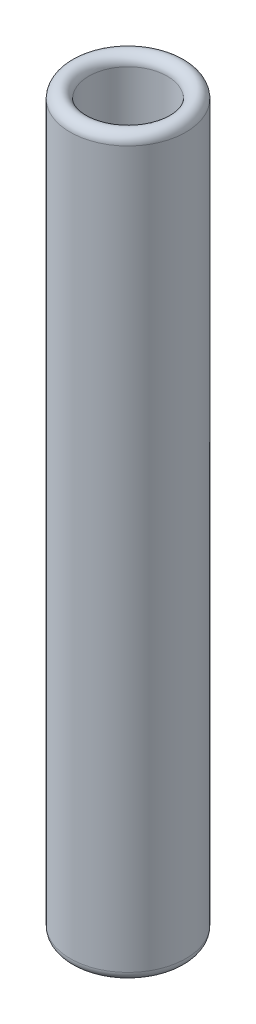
ISO-10303-21;
HEADER;
FILE_DESCRIPTION(('STEP AP214'),'2;1');
FILE_NAME('part.step','',(''),(''),'','','');
FILE_SCHEMA(('AUTOMOTIVE_DESIGN { 1 0 10303 214 1 1 1 1 }'));
ENDSEC;
DATA;
#1=APPLICATION_CONTEXT('core data for automotive mechanical design processes');
#2=APPLICATION_PROTOCOL_DEFINITION('international standard','automotive_design',2000,#1);
#3=PRODUCT_CONTEXT('',#1,'mechanical');
#4=PRODUCT('Part','Part','',(#3));
#5=PRODUCT_RELATED_PRODUCT_CATEGORY('part','',(#4));
#6=PRODUCT_DEFINITION_FORMATION('','',#4);
#7=PRODUCT_DEFINITION_CONTEXT('part definition',#1,'design');
#8=PRODUCT_DEFINITION('design','',#6,#7);
#9=PRODUCT_DEFINITION_SHAPE('','',#8);
#10=(LENGTH_UNIT() NAMED_UNIT(*) SI_UNIT(.MILLI.,.METRE.));
#11=(NAMED_UNIT(*) PLANE_ANGLE_UNIT() SI_UNIT($,.RADIAN.));
#12=(NAMED_UNIT(*) SI_UNIT($,.STERADIAN.) SOLID_ANGLE_UNIT());
#13=UNCERTAINTY_MEASURE_WITH_UNIT(LENGTH_MEASURE(1.E-05),#10,'distance_accuracy_value','');
#14=(GEOMETRIC_REPRESENTATION_CONTEXT(3) GLOBAL_UNCERTAINTY_ASSIGNED_CONTEXT((#13)) GLOBAL_UNIT_ASSIGNED_CONTEXT((#10,
#11,#12)) REPRESENTATION_CONTEXT('',''));
#15=CARTESIAN_POINT('',(0.,0.,0.));
#16=DIRECTION('',(0.,0.,1.));
#17=DIRECTION('',(1.,0.,0.));
#18=AXIS2_PLACEMENT_3D('',#15,#16,#17);
#19=CARTESIAN_POINT('',(0.,0.3683,0.));
#20=DIRECTION('',(0.,1.,0.));
#21=DIRECTION('',(0.,0.,1.));
#22=AXIS2_PLACEMENT_3D('',#19,#20,#21);
#23=TOROIDAL_SURFACE('',#22,1.9177,0.3683);
#24=CARTESIAN_POINT('',(0.,0.368299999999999,0.));
#25=DIRECTION('',(0.,1.,0.));
#26=DIRECTION('',(0.,0.,1.));
#27=AXIS2_PLACEMENT_3D('',#24,#25,#26);
#28=CIRCLE('',#27,2.286);
#29=CARTESIAN_POINT('',(0.,0.368299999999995,-2.286));
#30=VERTEX_POINT('',#29);
#31=EDGE_CURVE('E41',#30,#30,#28,.T.);
#32=ORIENTED_EDGE('',*,*,#31,.F.);
#33=EDGE_LOOP('',(#32));
#34=FACE_BOUND('',#33,.T.);
#35=CARTESIAN_POINT('',(0.,0.368300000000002,0.));
#36=DIRECTION('',(0.,1.,0.));
#37=DIRECTION('',(0.,0.,1.));
#38=AXIS2_PLACEMENT_3D('',#35,#36,#37);
#39=CIRCLE('',#38,1.5494);
#40=CARTESIAN_POINT('',(0.,0.368300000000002,-1.5494));
#41=VERTEX_POINT('',#40);
#42=EDGE_CURVE('E10',#41,#41,#39,.F.);
#43=ORIENTED_EDGE('',*,*,#42,.F.);
#44=EDGE_LOOP('',(#43));
#45=FACE_BOUND('',#44,.T.);
#46=ADVANCED_FACE('F34',(#34,#45),#23,.T.);
#47=CARTESIAN_POINT('',(0.,28.6317,0.));
#48=DIRECTION('',(0.,1.,0.));
#49=DIRECTION('',(0.,0.,1.));
#50=AXIS2_PLACEMENT_3D('',#47,#48,#49);
#51=TOROIDAL_SURFACE('',#50,1.9177,0.3683);
#52=CARTESIAN_POINT('',(0.,28.6317,0.));
#53=DIRECTION('',(0.,1.,0.));
#54=DIRECTION('',(0.,0.,1.));
#55=AXIS2_PLACEMENT_3D('',#52,#53,#54);
#56=CIRCLE('',#55,2.286);
#57=CARTESIAN_POINT('',(0.,28.6317,-2.286));
#58=VERTEX_POINT('',#57);
#59=EDGE_CURVE('E49',#58,#58,#56,.F.);
#60=ORIENTED_EDGE('',*,*,#59,.F.);
#61=EDGE_LOOP('',(#60));
#62=FACE_BOUND('',#61,.T.);
#63=CARTESIAN_POINT('',(0.,28.6317,0.));
#64=DIRECTION('',(0.,1.,0.));
#65=DIRECTION('',(0.,0.,1.));
#66=AXIS2_PLACEMENT_3D('',#63,#64,#65);
#67=CIRCLE('',#66,1.5494);
#68=CARTESIAN_POINT('',(0.,28.6317,-1.5494));
#69=VERTEX_POINT('',#68);
#70=EDGE_CURVE('E45',#69,#69,#67,.T.);
#71=ORIENTED_EDGE('',*,*,#70,.F.);
#72=EDGE_LOOP('',(#71));
#73=FACE_BOUND('',#72,.T.);
#74=ADVANCED_FACE('F57',(#62,#73),#51,.T.);
#75=CARTESIAN_POINT('',(0.,29.,0.));
#76=DIRECTION('',(0.,-1.,0.));
#77=DIRECTION('',(0.,0.,-1.));
#78=AXIS2_PLACEMENT_3D('',#75,#76,#77);
#79=CYLINDRICAL_SURFACE('',#78,2.286);
#80=CARTESIAN_POINT('',(0.,0.368299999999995,-2.286));
#81=CARTESIAN_POINT('',(0.,0.662710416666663,-2.286));
#82=CARTESIAN_POINT('',(0.,0.957120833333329,-2.286));
#83=CARTESIAN_POINT('',(0.,1.54594166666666,-2.286));
#84=CARTESIAN_POINT('',(0.,1.84035208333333,-2.286));
#85=CARTESIAN_POINT('',(0.,2.42917291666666,-2.286));
#86=CARTESIAN_POINT('',(0.,2.72358333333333,-2.286));
#87=CARTESIAN_POINT('',(0.,3.31240416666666,-2.286));
#88=CARTESIAN_POINT('',(0.,3.60681458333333,-2.286));
#89=CARTESIAN_POINT('',(0.,4.19563541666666,-2.286));
#90=CARTESIAN_POINT('',(0.,4.49004583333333,-2.286));
#91=CARTESIAN_POINT('',(0.,5.07886666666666,-2.286));
#92=CARTESIAN_POINT('',(0.,5.37327708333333,-2.286));
#93=CARTESIAN_POINT('',(0.,5.96209791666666,-2.286));
#94=CARTESIAN_POINT('',(0.,6.25650833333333,-2.286));
#95=CARTESIAN_POINT('',(0.,6.84532916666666,-2.286));
#96=CARTESIAN_POINT('',(0.,7.13973958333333,-2.286));
#97=CARTESIAN_POINT('',(0.,7.72856041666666,-2.286));
#98=CARTESIAN_POINT('',(0.,8.02297083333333,-2.286));
#99=CARTESIAN_POINT('',(0.,8.61179166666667,-2.286));
#100=CARTESIAN_POINT('',(0.,8.90620208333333,-2.286));
#101=CARTESIAN_POINT('',(0.,9.49502291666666,-2.286));
#102=CARTESIAN_POINT('',(0.,9.78943333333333,-2.286));
#103=CARTESIAN_POINT('',(0.,10.3782541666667,-2.286));
#104=CARTESIAN_POINT('',(0.,10.6726645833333,-2.286));
#105=CARTESIAN_POINT('',(0.,11.2614854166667,-2.286));
#106=CARTESIAN_POINT('',(0.,11.5558958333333,-2.286));
#107=CARTESIAN_POINT('',(0.,12.1447166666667,-2.286));
#108=CARTESIAN_POINT('',(0.,12.4391270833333,-2.286));
#109=CARTESIAN_POINT('',(0.,13.0279479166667,-2.286));
#110=CARTESIAN_POINT('',(0.,13.3223583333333,-2.286));
#111=CARTESIAN_POINT('',(0.,13.9111791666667,-2.286));
#112=CARTESIAN_POINT('',(0.,14.2055895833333,-2.286));
#113=CARTESIAN_POINT('',(0.,14.7944104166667,-2.286));
#114=CARTESIAN_POINT('',(0.,15.0888208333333,-2.286));
#115=CARTESIAN_POINT('',(0.,15.6776416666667,-2.286));
#116=CARTESIAN_POINT('',(0.,15.9720520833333,-2.286));
#117=CARTESIAN_POINT('',(0.,16.5608729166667,-2.286));
#118=CARTESIAN_POINT('',(0.,16.8552833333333,-2.286));
#119=CARTESIAN_POINT('',(0.,17.4441041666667,-2.286));
#120=CARTESIAN_POINT('',(0.,17.7385145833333,-2.286));
#121=CARTESIAN_POINT('',(0.,18.3273354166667,-2.286));
#122=CARTESIAN_POINT('',(0.,18.6217458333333,-2.286));
#123=CARTESIAN_POINT('',(0.,19.2105666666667,-2.286));
#124=CARTESIAN_POINT('',(0.,19.5049770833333,-2.286));
#125=CARTESIAN_POINT('',(0.,20.0937979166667,-2.286));
#126=CARTESIAN_POINT('',(0.,20.3882083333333,-2.286));
#127=CARTESIAN_POINT('',(0.,20.9770291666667,-2.286));
#128=CARTESIAN_POINT('',(0.,21.2714395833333,-2.286));
#129=CARTESIAN_POINT('',(0.,21.8602604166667,-2.286));
#130=CARTESIAN_POINT('',(0.,22.1546708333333,-2.286));
#131=CARTESIAN_POINT('',(0.,22.7434916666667,-2.286));
#132=CARTESIAN_POINT('',(0.,23.0379020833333,-2.286));
#133=CARTESIAN_POINT('',(0.,23.6267229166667,-2.286));
#134=CARTESIAN_POINT('',(0.,23.9211333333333,-2.286));
#135=CARTESIAN_POINT('',(0.,24.5099541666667,-2.286));
#136=CARTESIAN_POINT('',(0.,24.8043645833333,-2.286));
#137=CARTESIAN_POINT('',(0.,25.3931854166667,-2.286));
#138=CARTESIAN_POINT('',(0.,25.6875958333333,-2.286));
#139=CARTESIAN_POINT('',(0.,26.2764166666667,-2.286));
#140=CARTESIAN_POINT('',(0.,26.5708270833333,-2.286));
#141=CARTESIAN_POINT('',(0.,27.1596479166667,-2.286));
#142=CARTESIAN_POINT('',(0.,27.4540583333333,-2.286));
#143=CARTESIAN_POINT('',(0.,28.0428791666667,-2.286));
#144=CARTESIAN_POINT('',(0.,28.3372895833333,-2.286));
#145=CARTESIAN_POINT('',(0.,28.6317,-2.286));
#146=B_SPLINE_CURVE_WITH_KNOTS('',3,(#80,#81,#82,#83,#84,#85,#86,#87,#88,#89,#90,#91,#92,#93,
#94,#95,#96,#97,#98,#99,#100,#101,#102,#103,#104,#105,#106,#107,#108,#109,#110,#111,#112,#113,
#114,#115,#116,#117,#118,#119,#120,#121,#122,#123,#124,#125,#126,#127,#128,#129,#130,#131,#132,
#133,#134,#135,#136,#137,#138,#139,#140,#141,#142,#143,#144,#145),.UNSPECIFIED.,.F.,.F.,(4,2,2,
2,2,2,2,2,2,2,2,2,2,2,2,2,2,2,2,2,2,2,2,2,2,2,2,2,2,2,2,2,4),(0.,0.883231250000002,1.7664625,
2.64969375,3.532925,4.41615625,5.2993875,6.18261875,7.06585,7.94908125,8.8323125,9.71554375,
10.598775,11.48200625,12.3652375,13.24846875,14.1317,15.01493125,15.8981625,16.78139375,
17.664625,18.54785625,19.4310875,20.31431875,21.19755,22.08078125,22.9640125,23.84724375,
24.730475,25.61370625,26.4969375,27.38016875,28.2634),.UNSPECIFIED.);
#147=EDGE_CURVE('BSEAM55',#30,#58,#146,.T.);
#148=ORIENTED_EDGE('',*,*,#31,.T.);
#149=ORIENTED_EDGE('',*,*,#59,.T.);
#150=ORIENTED_EDGE('',*,*,#147,.T.);
#151=ORIENTED_EDGE('',*,*,#147,.F.);
#152=EDGE_LOOP('',(#148,#150,#149,#151));
#153=FACE_BOUND('',#152,.T.);
#154=ADVANCED_FACE('F55',(#153),#79,.T.);
#155=CARTESIAN_POINT('',(0.,29.,0.));
#156=DIRECTION('',(0.,-1.,0.));
#157=DIRECTION('',(0.,0.,-1.));
#158=AXIS2_PLACEMENT_3D('',#155,#156,#157);
#159=CYLINDRICAL_SURFACE('',#158,1.5494);
#160=CARTESIAN_POINT('',(0.,0.368300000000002,-1.5494));
#161=CARTESIAN_POINT('',(0.,0.662710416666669,-1.5494));
#162=CARTESIAN_POINT('',(0.,0.957120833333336,-1.5494));
#163=CARTESIAN_POINT('',(0.,1.54594166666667,-1.5494));
#164=CARTESIAN_POINT('',(0.,1.84035208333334,-1.5494));
#165=CARTESIAN_POINT('',(0.,2.42917291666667,-1.5494));
#166=CARTESIAN_POINT('',(0.,2.72358333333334,-1.5494));
#167=CARTESIAN_POINT('',(0.,3.31240416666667,-1.5494));
#168=CARTESIAN_POINT('',(0.,3.60681458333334,-1.5494));
#169=CARTESIAN_POINT('',(0.,4.19563541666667,-1.5494));
#170=CARTESIAN_POINT('',(0.,4.49004583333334,-1.5494));
#171=CARTESIAN_POINT('',(0.,5.07886666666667,-1.5494));
#172=CARTESIAN_POINT('',(0.,5.37327708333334,-1.5494));
#173=CARTESIAN_POINT('',(0.,5.96209791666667,-1.5494));
#174=CARTESIAN_POINT('',(0.,6.25650833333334,-1.5494));
#175=CARTESIAN_POINT('',(0.,6.84532916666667,-1.5494));
#176=CARTESIAN_POINT('',(0.,7.13973958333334,-1.5494));
#177=CARTESIAN_POINT('',(0.,7.72856041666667,-1.5494));
#178=CARTESIAN_POINT('',(0.,8.02297083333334,-1.5494));
#179=CARTESIAN_POINT('',(0.,8.61179166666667,-1.5494));
#180=CARTESIAN_POINT('',(0.,8.90620208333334,-1.5494));
#181=CARTESIAN_POINT('',(0.,9.49502291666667,-1.5494));
#182=CARTESIAN_POINT('',(0.,9.78943333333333,-1.5494));
#183=CARTESIAN_POINT('',(0.,10.3782541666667,-1.5494));
#184=CARTESIAN_POINT('',(0.,10.6726645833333,-1.5494));
#185=CARTESIAN_POINT('',(0.,11.2614854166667,-1.5494));
#186=CARTESIAN_POINT('',(0.,11.5558958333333,-1.5494));
#187=CARTESIAN_POINT('',(0.,12.1447166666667,-1.5494));
#188=CARTESIAN_POINT('',(0.,12.4391270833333,-1.5494));
#189=CARTESIAN_POINT('',(0.,13.0279479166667,-1.5494));
#190=CARTESIAN_POINT('',(0.,13.3223583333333,-1.5494));
#191=CARTESIAN_POINT('',(0.,13.9111791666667,-1.5494));
#192=CARTESIAN_POINT('',(0.,14.2055895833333,-1.5494));
#193=CARTESIAN_POINT('',(0.,14.7944104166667,-1.5494));
#194=CARTESIAN_POINT('',(0.,15.0888208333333,-1.5494));
#195=CARTESIAN_POINT('',(0.,15.6776416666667,-1.5494));
#196=CARTESIAN_POINT('',(0.,15.9720520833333,-1.5494));
#197=CARTESIAN_POINT('',(0.,16.5608729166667,-1.5494));
#198=CARTESIAN_POINT('',(0.,16.8552833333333,-1.5494));
#199=CARTESIAN_POINT('',(0.,17.4441041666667,-1.5494));
#200=CARTESIAN_POINT('',(0.,17.7385145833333,-1.5494));
#201=CARTESIAN_POINT('',(0.,18.3273354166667,-1.5494));
#202=CARTESIAN_POINT('',(0.,18.6217458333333,-1.5494));
#203=CARTESIAN_POINT('',(0.,19.2105666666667,-1.5494));
#204=CARTESIAN_POINT('',(0.,19.5049770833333,-1.5494));
#205=CARTESIAN_POINT('',(0.,20.0937979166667,-1.5494));
#206=CARTESIAN_POINT('',(0.,20.3882083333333,-1.5494));
#207=CARTESIAN_POINT('',(0.,20.9770291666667,-1.5494));
#208=CARTESIAN_POINT('',(0.,21.2714395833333,-1.5494));
#209=CARTESIAN_POINT('',(0.,21.8602604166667,-1.5494));
#210=CARTESIAN_POINT('',(0.,22.1546708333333,-1.5494));
#211=CARTESIAN_POINT('',(0.,22.7434916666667,-1.5494));
#212=CARTESIAN_POINT('',(0.,23.0379020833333,-1.5494));
#213=CARTESIAN_POINT('',(0.,23.6267229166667,-1.5494));
#214=CARTESIAN_POINT('',(0.,23.9211333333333,-1.5494));
#215=CARTESIAN_POINT('',(0.,24.5099541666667,-1.5494));
#216=CARTESIAN_POINT('',(0.,24.8043645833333,-1.5494));
#217=CARTESIAN_POINT('',(0.,25.3931854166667,-1.5494));
#218=CARTESIAN_POINT('',(0.,25.6875958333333,-1.5494));
#219=CARTESIAN_POINT('',(0.,26.2764166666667,-1.5494));
#220=CARTESIAN_POINT('',(0.,26.5708270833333,-1.5494));
#221=CARTESIAN_POINT('',(0.,27.1596479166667,-1.5494));
#222=CARTESIAN_POINT('',(0.,27.4540583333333,-1.5494));
#223=CARTESIAN_POINT('',(0.,28.0428791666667,-1.5494));
#224=CARTESIAN_POINT('',(0.,28.3372895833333,-1.5494));
#225=CARTESIAN_POINT('',(0.,28.6317,-1.5494));
#226=B_SPLINE_CURVE_WITH_KNOTS('',3,(#160,#161,#162,#163,#164,#165,#166,#167,#168,#169,#170,
#171,#172,#173,#174,#175,#176,#177,#178,#179,#180,#181,#182,#183,#184,#185,#186,#187,#188,#189,
#190,#191,#192,#193,#194,#195,#196,#197,#198,#199,#200,#201,#202,#203,#204,#205,#206,#207,#208,
#209,#210,#211,#212,#213,#214,#215,#216,#217,#218,#219,#220,#221,#222,#223,#224,#225),
.UNSPECIFIED.,.F.,.F.,(4,2,2,2,2,2,2,2,2,2,2,2,2,2,2,2,2,2,2,2,2,2,2,2,2,2,2,2,2,2,2,2,4),(0.,
0.883231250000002,1.7664625,2.64969375,3.532925,4.41615625,5.2993875,6.18261875,7.06585,
7.94908125,8.8323125,9.71554375,10.598775,11.48200625,12.3652375,13.24846875,14.1317,
15.01493125,15.8981625,16.78139375,17.664625,18.54785625,19.4310875,20.31431875,21.19755,
22.08078125,22.9640125,23.84724375,24.730475,25.61370625,26.4969375,27.38016875,28.2634),.UNSPECIFIED.);
#227=EDGE_CURVE('BSEAM62',#41,#69,#226,.T.);
#228=ORIENTED_EDGE('',*,*,#42,.T.);
#229=ORIENTED_EDGE('',*,*,#70,.T.);
#230=ORIENTED_EDGE('',*,*,#227,.T.);
#231=ORIENTED_EDGE('',*,*,#227,.F.);
#232=EDGE_LOOP('',(#228,#230,#229,#231));
#233=FACE_BOUND('',#232,.T.);
#234=ADVANCED_FACE('F62',(#233),#159,.F.);
#235=CLOSED_SHELL('',(#46,#74,#154,#234));
#236=MANIFOLD_SOLID_BREP('B2',#235);
#237=ADVANCED_BREP_SHAPE_REPRESENTATION('',(#18,#236),#14);
#238=SHAPE_DEFINITION_REPRESENTATION(#9,#237);
ENDSEC;
END-ISO-10303-21;
